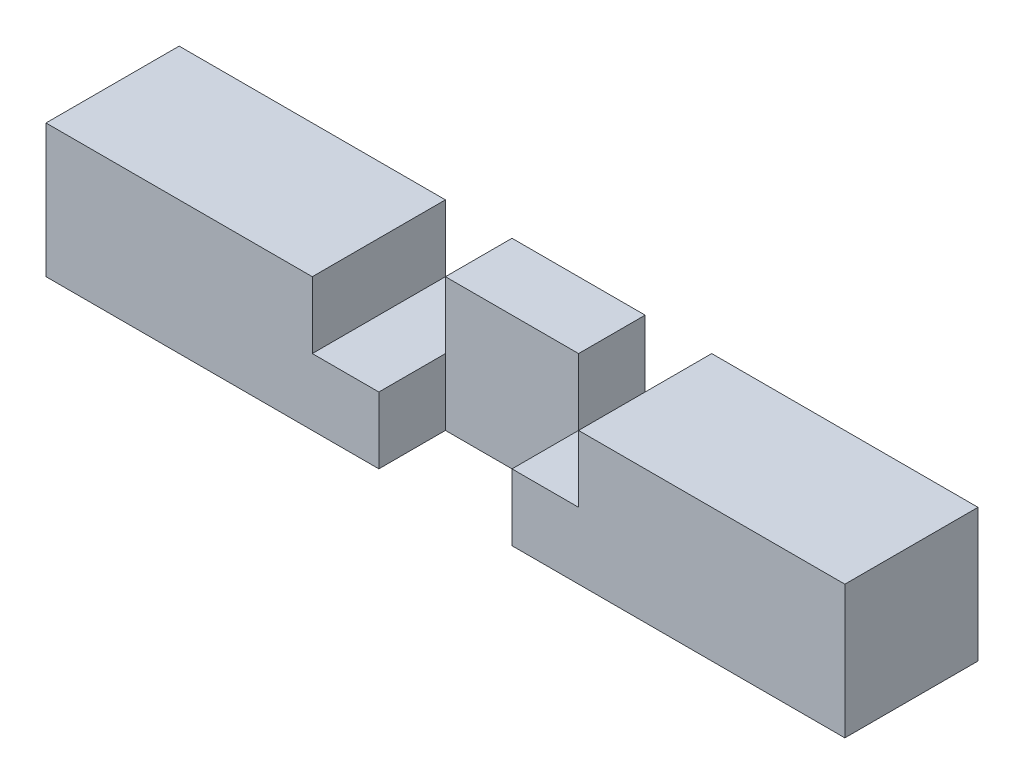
ISO-10303-21;
HEADER;
FILE_DESCRIPTION(('STEP AP214'),'2;1');
FILE_NAME('part.step','',(''),(''),'','','');
FILE_SCHEMA(('AUTOMOTIVE_DESIGN { 1 0 10303 214 1 1 1 1 }'));
ENDSEC;
DATA;
#1=APPLICATION_CONTEXT('core data for automotive mechanical design processes');
#2=APPLICATION_PROTOCOL_DEFINITION('international standard','automotive_design',2000,#1);
#3=PRODUCT_CONTEXT('',#1,'mechanical');
#4=PRODUCT('Part','Part','',(#3));
#5=PRODUCT_RELATED_PRODUCT_CATEGORY('part','',(#4));
#6=PRODUCT_DEFINITION_FORMATION('','',#4);
#7=PRODUCT_DEFINITION_CONTEXT('part definition',#1,'design');
#8=PRODUCT_DEFINITION('design','',#6,#7);
#9=PRODUCT_DEFINITION_SHAPE('','',#8);
#10=(LENGTH_UNIT() NAMED_UNIT(*) SI_UNIT(.MILLI.,.METRE.));
#11=(NAMED_UNIT(*) PLANE_ANGLE_UNIT() SI_UNIT($,.RADIAN.));
#12=(NAMED_UNIT(*) SI_UNIT($,.STERADIAN.) SOLID_ANGLE_UNIT());
#13=UNCERTAINTY_MEASURE_WITH_UNIT(LENGTH_MEASURE(1.E-05),#10,'distance_accuracy_value','');
#14=(GEOMETRIC_REPRESENTATION_CONTEXT(3) GLOBAL_UNCERTAINTY_ASSIGNED_CONTEXT((#13)) GLOBAL_UNIT_ASSIGNED_CONTEXT((#10,
#11,#12)) REPRESENTATION_CONTEXT('',''));
#15=CARTESIAN_POINT('',(0.,0.,0.));
#16=DIRECTION('',(0.,0.,1.));
#17=DIRECTION('',(1.,0.,0.));
#18=AXIS2_PLACEMENT_3D('',#15,#16,#17);
#19=CARTESIAN_POINT('',(0.,20.,0.));
#20=DIRECTION('',(0.,0.,-1.));
#21=DIRECTION('',(-1.,0.,0.));
#22=AXIS2_PLACEMENT_3D('',#19,#20,#21);
#23=PLANE('',#22);
#24=DIRECTION('',(1.,0.,0.));
#25=VECTOR('',#24,1.);
#26=CARTESIAN_POINT('',(0.,0.,0.));
#27=LINE('',#26,#25);
#28=CARTESIAN_POINT('',(0.,0.,0.));
#29=VERTEX_POINT('',#28);
#30=CARTESIAN_POINT('',(50.,0.,0.));
#31=VERTEX_POINT('',#30);
#32=EDGE_CURVE('E166',#29,#31,#27,.T.);
#33=ORIENTED_EDGE('',*,*,#32,.T.);
#34=DIRECTION('',(0.,1.,0.));
#35=VECTOR('',#34,1.);
#36=CARTESIAN_POINT('',(50.,0.,0.));
#37=LINE('',#36,#35);
#38=CARTESIAN_POINT('',(50.,10.,0.));
#39=VERTEX_POINT('',#38);
#40=EDGE_CURVE('E149',#31,#39,#37,.T.);
#41=ORIENTED_EDGE('',*,*,#40,.T.);
#42=DIRECTION('',(1.,0.,0.));
#43=VECTOR('',#42,1.);
#44=CARTESIAN_POINT('',(40.,10.,0.));
#45=LINE('',#44,#43);
#46=CARTESIAN_POINT('',(40.,10.,0.));
#47=VERTEX_POINT('',#46);
#48=EDGE_CURVE('E209',#47,#39,#45,.T.);
#49=ORIENTED_EDGE('',*,*,#48,.F.);
#50=DIRECTION('',(0.,-1.,0.));
#51=VECTOR('',#50,1.);
#52=CARTESIAN_POINT('',(40.,20.,0.));
#53=LINE('',#52,#51);
#54=CARTESIAN_POINT('',(40.,20.,0.));
#55=VERTEX_POINT('',#54);
#56=EDGE_CURVE('E248',#55,#47,#53,.T.);
#57=ORIENTED_EDGE('',*,*,#56,.F.);
#58=DIRECTION('',(1.,0.,0.));
#59=VECTOR('',#58,1.);
#60=CARTESIAN_POINT('',(0.,20.,0.));
#61=LINE('',#60,#59);
#62=CARTESIAN_POINT('',(0.,20.,0.));
#63=VERTEX_POINT('',#62);
#64=EDGE_CURVE('E84',#63,#55,#61,.T.);
#65=ORIENTED_EDGE('',*,*,#64,.F.);
#66=DIRECTION('',(0.,-1.,0.));
#67=VECTOR('',#66,1.);
#68=CARTESIAN_POINT('',(0.,20.,0.));
#69=LINE('',#68,#67);
#70=EDGE_CURVE('E11',#63,#29,#69,.T.);
#71=ORIENTED_EDGE('',*,*,#70,.T.);
#72=EDGE_LOOP('',(#33,#41,#49,#57,#65,#71));
#73=FACE_BOUND('',#72,.T.);
#74=ADVANCED_FACE('F31',(#73),#23,.F.);
#75=CARTESIAN_POINT('',(0.,20.,-20.));
#76=DIRECTION('',(0.,-1.,0.));
#77=DIRECTION('',(0.,0.,-1.));
#78=AXIS2_PLACEMENT_3D('',#75,#76,#77);
#79=PLANE('',#78);
#80=DIRECTION('',(0.,0.,1.));
#81=VECTOR('',#80,1.);
#82=CARTESIAN_POINT('',(50.,20.,-20.));
#83=LINE('',#82,#81);
#84=CARTESIAN_POINT('',(50.,20.,-20.));
#85=VERTEX_POINT('',#84);
#86=CARTESIAN_POINT('',(50.,20.,-10.));
#87=VERTEX_POINT('',#86);
#88=EDGE_CURVE('E201',#85,#87,#83,.T.);
#89=ORIENTED_EDGE('',*,*,#88,.T.);
#90=DIRECTION('',(-1.,0.,0.));
#91=VECTOR('',#90,1.);
#92=CARTESIAN_POINT('',(50.,20.,-10.));
#93=LINE('',#92,#91);
#94=CARTESIAN_POINT('',(70.,20.,-10.));
#95=VERTEX_POINT('',#94);
#96=EDGE_CURVE('E170',#95,#87,#93,.T.);
#97=ORIENTED_EDGE('',*,*,#96,.F.);
#98=DIRECTION('',(0.,0.,1.));
#99=VECTOR('',#98,1.);
#100=CARTESIAN_POINT('',(70.,20.,-20.));
#101=LINE('',#100,#99);
#102=CARTESIAN_POINT('',(70.,20.,-20.));
#103=VERTEX_POINT('',#102);
#104=EDGE_CURVE('E231',#103,#95,#101,.T.);
#105=ORIENTED_EDGE('',*,*,#104,.F.);
#106=DIRECTION('',(-1.,0.,0.));
#107=VECTOR('',#106,1.);
#108=CARTESIAN_POINT('',(0.,20.,-20.));
#109=LINE('',#108,#107);
#110=EDGE_CURVE('E221',#103,#85,#109,.T.);
#111=ORIENTED_EDGE('',*,*,#110,.T.);
#112=EDGE_LOOP('',(#89,#97,#105,#111));
#113=FACE_BOUND('',#112,.T.);
#114=ADVANCED_FACE('F228',(#113),#79,.F.);
#115=ORIENTED_EDGE('',*,*,#64,.T.);
#116=DIRECTION('',(0.,0.,1.));
#117=VECTOR('',#116,1.);
#118=CARTESIAN_POINT('',(40.,20.,-20.));
#119=LINE('',#118,#117);
#120=CARTESIAN_POINT('',(40.,20.,-20.));
#121=VERTEX_POINT('',#120);
#122=EDGE_CURVE('E200',#121,#55,#119,.T.);
#123=ORIENTED_EDGE('',*,*,#122,.F.);
#124=CARTESIAN_POINT('',(0.,20.,-20.));
#125=VERTEX_POINT('',#124);
#126=EDGE_CURVE('E55',#121,#125,#109,.T.);
#127=ORIENTED_EDGE('',*,*,#126,.T.);
#128=DIRECTION('',(0.,0.,1.));
#129=VECTOR('',#128,1.);
#130=CARTESIAN_POINT('',(0.,20.,0.));
#131=LINE('',#130,#129);
#132=EDGE_CURVE('E183',#125,#63,#131,.T.);
#133=ORIENTED_EDGE('',*,*,#132,.T.);
#134=EDGE_LOOP('',(#115,#123,#127,#133));
#135=FACE_BOUND('',#134,.T.);
#136=ADVANCED_FACE('F263',(#135),#79,.F.);
#137=CARTESIAN_POINT('',(0.,20.,0.));
#138=DIRECTION('',(1.,0.,0.));
#139=DIRECTION('',(0.,0.,-1.));
#140=AXIS2_PLACEMENT_3D('',#137,#138,#139);
#141=PLANE('',#140);
#142=DIRECTION('',(0.,0.,1.));
#143=VECTOR('',#142,1.);
#144=CARTESIAN_POINT('',(0.,0.,0.));
#145=LINE('',#144,#143);
#146=CARTESIAN_POINT('',(0.,0.,-20.));
#147=VERTEX_POINT('',#146);
#148=EDGE_CURVE('E178',#147,#29,#145,.T.);
#149=ORIENTED_EDGE('',*,*,#148,.T.);
#150=ORIENTED_EDGE('',*,*,#70,.F.);
#151=ORIENTED_EDGE('',*,*,#132,.F.);
#152=DIRECTION('',(0.,-1.,0.));
#153=VECTOR('',#152,1.);
#154=CARTESIAN_POINT('',(0.,20.,-20.));
#155=LINE('',#154,#153);
#156=EDGE_CURVE('E184',#125,#147,#155,.T.);
#157=ORIENTED_EDGE('',*,*,#156,.T.);
#158=EDGE_LOOP('',(#149,#150,#151,#157));
#159=FACE_BOUND('',#158,.T.);
#160=ADVANCED_FACE('F33',(#159),#141,.F.);
#161=DIRECTION('',(1.,0.,0.));
#162=VECTOR('',#161,1.);
#163=CARTESIAN_POINT('',(70.,10.,0.));
#164=LINE('',#163,#162);
#165=CARTESIAN_POINT('',(70.,10.,0.));
#166=VERTEX_POINT('',#165);
#167=CARTESIAN_POINT('',(80.,10.,0.));
#168=VERTEX_POINT('',#167);
#169=EDGE_CURVE('E322',#166,#168,#164,.T.);
#170=ORIENTED_EDGE('',*,*,#169,.F.);
#171=DIRECTION('',(0.,1.,0.));
#172=VECTOR('',#171,1.);
#173=CARTESIAN_POINT('',(70.,0.,0.));
#174=LINE('',#173,#172);
#175=CARTESIAN_POINT('',(70.,0.,0.));
#176=VERTEX_POINT('',#175);
#177=EDGE_CURVE('E160',#176,#166,#174,.T.);
#178=ORIENTED_EDGE('',*,*,#177,.F.);
#179=CARTESIAN_POINT('',(120.,0.,0.));
#180=VERTEX_POINT('',#179);
#181=EDGE_CURVE('E175',#176,#180,#27,.T.);
#182=ORIENTED_EDGE('',*,*,#181,.T.);
#183=DIRECTION('',(0.,-1.,0.));
#184=VECTOR('',#183,1.);
#185=CARTESIAN_POINT('',(120.,20.,0.));
#186=LINE('',#185,#184);
#187=CARTESIAN_POINT('',(120.,20.,0.));
#188=VERTEX_POINT('',#187);
#189=EDGE_CURVE('E39',#188,#180,#186,.T.);
#190=ORIENTED_EDGE('',*,*,#189,.F.);
#191=CARTESIAN_POINT('',(80.,20.,0.));
#192=VERTEX_POINT('',#191);
#193=EDGE_CURVE('E218',#192,#188,#61,.T.);
#194=ORIENTED_EDGE('',*,*,#193,.F.);
#195=DIRECTION('',(0.,1.,0.));
#196=VECTOR('',#195,1.);
#197=CARTESIAN_POINT('',(80.,20.,0.));
#198=LINE('',#197,#196);
#199=EDGE_CURVE('E46',#168,#192,#198,.T.);
#200=ORIENTED_EDGE('',*,*,#199,.F.);
#201=EDGE_LOOP('',(#170,#178,#182,#190,#194,#200));
#202=FACE_BOUND('',#201,.T.);
#203=ADVANCED_FACE('F266',(#202),#23,.F.);
#204=CARTESIAN_POINT('',(120.,20.,0.));
#205=DIRECTION('',(-1.,0.,0.));
#206=DIRECTION('',(0.,0.,1.));
#207=AXIS2_PLACEMENT_3D('',#204,#205,#206);
#208=PLANE('',#207);
#209=DIRECTION('',(0.,0.,-1.));
#210=VECTOR('',#209,1.);
#211=CARTESIAN_POINT('',(120.,0.,0.));
#212=LINE('',#211,#210);
#213=CARTESIAN_POINT('',(120.,0.,-20.));
#214=VERTEX_POINT('',#213);
#215=EDGE_CURVE('E174',#180,#214,#212,.T.);
#216=ORIENTED_EDGE('',*,*,#215,.T.);
#217=DIRECTION('',(0.,-1.,0.));
#218=VECTOR('',#217,1.);
#219=CARTESIAN_POINT('',(120.,20.,-20.));
#220=LINE('',#219,#218);
#221=CARTESIAN_POINT('',(120.,20.,-20.));
#222=VERTEX_POINT('',#221);
#223=EDGE_CURVE('E186',#222,#214,#220,.T.);
#224=ORIENTED_EDGE('',*,*,#223,.F.);
#225=DIRECTION('',(0.,0.,-1.));
#226=VECTOR('',#225,1.);
#227=CARTESIAN_POINT('',(120.,20.,0.));
#228=LINE('',#227,#226);
#229=EDGE_CURVE('E195',#188,#222,#228,.T.);
#230=ORIENTED_EDGE('',*,*,#229,.F.);
#231=ORIENTED_EDGE('',*,*,#189,.T.);
#232=EDGE_LOOP('',(#216,#224,#230,#231));
#233=FACE_BOUND('',#232,.T.);
#234=ADVANCED_FACE('F193',(#233),#208,.F.);
#235=CARTESIAN_POINT('',(0.,20.,-20.));
#236=DIRECTION('',(0.,0.,1.));
#237=DIRECTION('',(1.,0.,0.));
#238=AXIS2_PLACEMENT_3D('',#235,#236,#237);
#239=PLANE('',#238);
#240=ORIENTED_EDGE('',*,*,#110,.F.);
#241=DIRECTION('',(0.,-1.,0.));
#242=VECTOR('',#241,1.);
#243=CARTESIAN_POINT('',(70.,20.,-20.));
#244=LINE('',#243,#242);
#245=CARTESIAN_POINT('',(70.,10.,-20.));
#246=VERTEX_POINT('',#245);
#247=EDGE_CURVE('E326',#103,#246,#244,.T.);
#248=ORIENTED_EDGE('',*,*,#247,.T.);
#249=DIRECTION('',(1.,0.,0.));
#250=VECTOR('',#249,1.);
#251=CARTESIAN_POINT('',(70.,10.,-20.));
#252=LINE('',#251,#250);
#253=CARTESIAN_POINT('',(80.,10.,-20.));
#254=VERTEX_POINT('',#253);
#255=EDGE_CURVE('E328',#246,#254,#252,.T.);
#256=ORIENTED_EDGE('',*,*,#255,.T.);
#257=DIRECTION('',(0.,1.,0.));
#258=VECTOR('',#257,1.);
#259=CARTESIAN_POINT('',(80.,20.,-20.));
#260=LINE('',#259,#258);
#261=CARTESIAN_POINT('',(80.,20.,-20.));
#262=VERTEX_POINT('',#261);
#263=EDGE_CURVE('E331',#254,#262,#260,.T.);
#264=ORIENTED_EDGE('',*,*,#263,.T.);
#265=EDGE_CURVE('E187',#222,#262,#109,.T.);
#266=ORIENTED_EDGE('',*,*,#265,.F.);
#267=ORIENTED_EDGE('',*,*,#223,.T.);
#268=DIRECTION('',(-1.,0.,0.));
#269=VECTOR('',#268,1.);
#270=CARTESIAN_POINT('',(0.,0.,-20.));
#271=LINE('',#270,#269);
#272=EDGE_CURVE('E77',#214,#147,#271,.T.);
#273=ORIENTED_EDGE('',*,*,#272,.T.);
#274=ORIENTED_EDGE('',*,*,#156,.F.);
#275=ORIENTED_EDGE('',*,*,#126,.F.);
#276=DIRECTION('',(0.,-1.,0.));
#277=VECTOR('',#276,1.);
#278=CARTESIAN_POINT('',(40.,20.,-20.));
#279=LINE('',#278,#277);
#280=CARTESIAN_POINT('',(40.,10.,-20.));
#281=VERTEX_POINT('',#280);
#282=EDGE_CURVE('E245',#121,#281,#279,.T.);
#283=ORIENTED_EDGE('',*,*,#282,.T.);
#284=DIRECTION('',(1.,0.,0.));
#285=VECTOR('',#284,1.);
#286=CARTESIAN_POINT('',(40.,10.,-20.));
#287=LINE('',#286,#285);
#288=CARTESIAN_POINT('',(50.,10.,-20.));
#289=VERTEX_POINT('',#288);
#290=EDGE_CURVE('E243',#281,#289,#287,.T.);
#291=ORIENTED_EDGE('',*,*,#290,.T.);
#292=DIRECTION('',(0.,1.,0.));
#293=VECTOR('',#292,1.);
#294=CARTESIAN_POINT('',(50.,20.,-20.));
#295=LINE('',#294,#293);
#296=EDGE_CURVE('E216',#289,#85,#295,.T.);
#297=ORIENTED_EDGE('',*,*,#296,.T.);
#298=EDGE_LOOP('',(#240,#248,#256,#264,#266,#267,#273,#274,#275,#283,#291,#297));
#299=FACE_BOUND('',#298,.T.);
#300=ADVANCED_FACE('F240',(#299),#239,.F.);
#301=ORIENTED_EDGE('',*,*,#265,.T.);
#302=DIRECTION('',(0.,0.,1.));
#303=VECTOR('',#302,1.);
#304=CARTESIAN_POINT('',(80.,20.,-20.));
#305=LINE('',#304,#303);
#306=EDGE_CURVE('E249',#262,#192,#305,.T.);
#307=ORIENTED_EDGE('',*,*,#306,.T.);
#308=ORIENTED_EDGE('',*,*,#193,.T.);
#309=ORIENTED_EDGE('',*,*,#229,.T.);
#310=EDGE_LOOP('',(#301,#307,#308,#309));
#311=FACE_BOUND('',#310,.T.);
#312=ADVANCED_FACE('F272',(#311),#79,.F.);
#313=CARTESIAN_POINT('',(0.,0.,-20.));
#314=DIRECTION('',(0.,-1.,0.));
#315=DIRECTION('',(0.,0.,-1.));
#316=AXIS2_PLACEMENT_3D('',#313,#314,#315);
#317=PLANE('',#316);
#318=DIRECTION('',(0.,0.,1.));
#319=VECTOR('',#318,1.);
#320=CARTESIAN_POINT('',(50.,0.,0.));
#321=LINE('',#320,#319);
#322=CARTESIAN_POINT('',(50.,0.,-10.));
#323=VERTEX_POINT('',#322);
#324=EDGE_CURVE('E153',#323,#31,#321,.T.);
#325=ORIENTED_EDGE('',*,*,#324,.T.);
#326=ORIENTED_EDGE('',*,*,#32,.F.);
#327=ORIENTED_EDGE('',*,*,#148,.F.);
#328=ORIENTED_EDGE('',*,*,#272,.F.);
#329=ORIENTED_EDGE('',*,*,#215,.F.);
#330=ORIENTED_EDGE('',*,*,#181,.F.);
#331=DIRECTION('',(0.,0.,-1.));
#332=VECTOR('',#331,1.);
#333=CARTESIAN_POINT('',(70.,0.,0.));
#334=LINE('',#333,#332);
#335=CARTESIAN_POINT('',(70.,0.,-10.));
#336=VERTEX_POINT('',#335);
#337=EDGE_CURVE('E169',#176,#336,#334,.T.);
#338=ORIENTED_EDGE('',*,*,#337,.T.);
#339=DIRECTION('',(-1.,0.,0.));
#340=VECTOR('',#339,1.);
#341=CARTESIAN_POINT('',(50.,0.,-10.));
#342=LINE('',#341,#340);
#343=EDGE_CURVE('E161',#336,#323,#342,.T.);
#344=ORIENTED_EDGE('',*,*,#343,.T.);
#345=EDGE_LOOP('',(#325,#326,#327,#328,#329,#330,#338,#344));
#346=FACE_BOUND('',#345,.T.);
#347=ADVANCED_FACE('F164',(#346),#317,.T.);
#348=CARTESIAN_POINT('',(40.,20.,-20.));
#349=DIRECTION('',(-1.,0.,0.));
#350=DIRECTION('',(0.,0.,1.));
#351=AXIS2_PLACEMENT_3D('',#348,#349,#350);
#352=PLANE('',#351);
#353=ORIENTED_EDGE('',*,*,#56,.T.);
#354=DIRECTION('',(0.,0.,1.));
#355=VECTOR('',#354,1.);
#356=CARTESIAN_POINT('',(40.,10.,-20.));
#357=LINE('',#356,#355);
#358=EDGE_CURVE('E214',#281,#47,#357,.T.);
#359=ORIENTED_EDGE('',*,*,#358,.F.);
#360=ORIENTED_EDGE('',*,*,#282,.F.);
#361=ORIENTED_EDGE('',*,*,#122,.T.);
#362=EDGE_LOOP('',(#353,#359,#360,#361));
#363=FACE_BOUND('',#362,.T.);
#364=ADVANCED_FACE('F262',(#363),#352,.F.);
#365=CARTESIAN_POINT('',(50.,20.,-20.));
#366=DIRECTION('',(1.,0.,0.));
#367=DIRECTION('',(0.,0.,-1.));
#368=AXIS2_PLACEMENT_3D('',#365,#366,#367);
#369=PLANE('',#368);
#370=DIRECTION('',(0.,0.,1.));
#371=VECTOR('',#370,1.);
#372=CARTESIAN_POINT('',(50.,10.,-20.));
#373=LINE('',#372,#371);
#374=CARTESIAN_POINT('',(50.,10.,-10.));
#375=VERTEX_POINT('',#374);
#376=EDGE_CURVE('E206',#289,#375,#373,.T.);
#377=ORIENTED_EDGE('',*,*,#376,.T.);
#378=DIRECTION('',(0.,1.,0.));
#379=VECTOR('',#378,1.);
#380=CARTESIAN_POINT('',(50.,0.,-10.));
#381=LINE('',#380,#379);
#382=EDGE_CURVE('E239',#375,#87,#381,.T.);
#383=ORIENTED_EDGE('',*,*,#382,.T.);
#384=ORIENTED_EDGE('',*,*,#88,.F.);
#385=ORIENTED_EDGE('',*,*,#296,.F.);
#386=EDGE_LOOP('',(#377,#383,#384,#385));
#387=FACE_BOUND('',#386,.T.);
#388=ADVANCED_FACE('F237',(#387),#369,.F.);
#389=CARTESIAN_POINT('',(40.,10.,-20.));
#390=DIRECTION('',(0.,-1.,0.));
#391=DIRECTION('',(0.,0.,-1.));
#392=AXIS2_PLACEMENT_3D('',#389,#390,#391);
#393=PLANE('',#392);
#394=ORIENTED_EDGE('',*,*,#48,.T.);
#395=EDGE_CURVE('E156',#375,#39,#373,.T.);
#396=ORIENTED_EDGE('',*,*,#395,.F.);
#397=ORIENTED_EDGE('',*,*,#376,.F.);
#398=ORIENTED_EDGE('',*,*,#290,.F.);
#399=ORIENTED_EDGE('',*,*,#358,.T.);
#400=EDGE_LOOP('',(#394,#396,#397,#398,#399));
#401=FACE_BOUND('',#400,.T.);
#402=ADVANCED_FACE('F287',(#401),#393,.F.);
#403=CARTESIAN_POINT('',(70.,20.,-20.));
#404=DIRECTION('',(-1.,0.,0.));
#405=DIRECTION('',(0.,0.,1.));
#406=AXIS2_PLACEMENT_3D('',#403,#404,#405);
#407=PLANE('',#406);
#408=ORIENTED_EDGE('',*,*,#104,.T.);
#409=DIRECTION('',(0.,1.,0.));
#410=VECTOR('',#409,1.);
#411=CARTESIAN_POINT('',(70.,0.,-10.));
#412=LINE('',#411,#410);
#413=CARTESIAN_POINT('',(70.,10.,-10.));
#414=VERTEX_POINT('',#413);
#415=EDGE_CURVE('E315',#414,#95,#412,.T.);
#416=ORIENTED_EDGE('',*,*,#415,.F.);
#417=DIRECTION('',(0.,0.,1.));
#418=VECTOR('',#417,1.);
#419=CARTESIAN_POINT('',(70.,10.,-20.));
#420=LINE('',#419,#418);
#421=EDGE_CURVE('E259',#246,#414,#420,.T.);
#422=ORIENTED_EDGE('',*,*,#421,.F.);
#423=ORIENTED_EDGE('',*,*,#247,.F.);
#424=EDGE_LOOP('',(#408,#416,#422,#423));
#425=FACE_BOUND('',#424,.T.);
#426=ADVANCED_FACE('F290',(#425),#407,.F.);
#427=CARTESIAN_POINT('',(80.,20.,-20.));
#428=DIRECTION('',(1.,0.,0.));
#429=DIRECTION('',(0.,0.,-1.));
#430=AXIS2_PLACEMENT_3D('',#427,#428,#429);
#431=PLANE('',#430);
#432=ORIENTED_EDGE('',*,*,#199,.T.);
#433=ORIENTED_EDGE('',*,*,#306,.F.);
#434=ORIENTED_EDGE('',*,*,#263,.F.);
#435=DIRECTION('',(0.,0.,1.));
#436=VECTOR('',#435,1.);
#437=CARTESIAN_POINT('',(80.,10.,-20.));
#438=LINE('',#437,#436);
#439=EDGE_CURVE('E253',#254,#168,#438,.T.);
#440=ORIENTED_EDGE('',*,*,#439,.T.);
#441=EDGE_LOOP('',(#432,#433,#434,#440));
#442=FACE_BOUND('',#441,.T.);
#443=ADVANCED_FACE('F296',(#442),#431,.F.);
#444=CARTESIAN_POINT('',(70.,10.,-20.));
#445=DIRECTION('',(0.,-1.,0.));
#446=DIRECTION('',(0.,0.,-1.));
#447=AXIS2_PLACEMENT_3D('',#444,#445,#446);
#448=PLANE('',#447);
#449=ORIENTED_EDGE('',*,*,#169,.T.);
#450=ORIENTED_EDGE('',*,*,#439,.F.);
#451=ORIENTED_EDGE('',*,*,#255,.F.);
#452=ORIENTED_EDGE('',*,*,#421,.T.);
#453=EDGE_CURVE('E261',#414,#166,#420,.T.);
#454=ORIENTED_EDGE('',*,*,#453,.T.);
#455=EDGE_LOOP('',(#449,#450,#451,#452,#454));
#456=FACE_BOUND('',#455,.T.);
#457=ADVANCED_FACE('F297',(#456),#448,.F.);
#458=CARTESIAN_POINT('',(50.,0.,0.));
#459=DIRECTION('',(-1.,0.,0.));
#460=DIRECTION('',(0.,0.,1.));
#461=AXIS2_PLACEMENT_3D('',#458,#459,#460);
#462=PLANE('',#461);
#463=ORIENTED_EDGE('',*,*,#40,.F.);
#464=ORIENTED_EDGE('',*,*,#324,.F.);
#465=EDGE_CURVE('E320',#323,#375,#381,.T.);
#466=ORIENTED_EDGE('',*,*,#465,.T.);
#467=ORIENTED_EDGE('',*,*,#395,.T.);
#468=EDGE_LOOP('',(#463,#464,#466,#467));
#469=FACE_BOUND('',#468,.T.);
#470=ADVANCED_FACE('F151',(#469),#462,.F.);
#471=CARTESIAN_POINT('',(70.,0.,0.));
#472=DIRECTION('',(1.,0.,0.));
#473=DIRECTION('',(0.,0.,-1.));
#474=AXIS2_PLACEMENT_3D('',#471,#472,#473);
#475=PLANE('',#474);
#476=EDGE_CURVE('E323',#336,#414,#412,.T.);
#477=ORIENTED_EDGE('',*,*,#476,.F.);
#478=ORIENTED_EDGE('',*,*,#337,.F.);
#479=ORIENTED_EDGE('',*,*,#177,.T.);
#480=ORIENTED_EDGE('',*,*,#453,.F.);
#481=EDGE_LOOP('',(#477,#478,#479,#480));
#482=FACE_BOUND('',#481,.T.);
#483=ADVANCED_FACE('F305',(#482),#475,.F.);
#484=CARTESIAN_POINT('',(50.,0.,-10.));
#485=DIRECTION('',(0.,0.,-1.));
#486=DIRECTION('',(-1.,0.,0.));
#487=AXIS2_PLACEMENT_3D('',#484,#485,#486);
#488=PLANE('',#487);
#489=ORIENTED_EDGE('',*,*,#96,.T.);
#490=ORIENTED_EDGE('',*,*,#382,.F.);
#491=ORIENTED_EDGE('',*,*,#465,.F.);
#492=ORIENTED_EDGE('',*,*,#343,.F.);
#493=ORIENTED_EDGE('',*,*,#476,.T.);
#494=ORIENTED_EDGE('',*,*,#415,.T.);
#495=EDGE_LOOP('',(#489,#490,#491,#492,#493,#494));
#496=FACE_BOUND('',#495,.T.);
#497=ADVANCED_FACE('F308',(#496),#488,.F.);
#498=CLOSED_SHELL('',(#74,#114,#136,#160,#203,#234,#300,#312,#347,#364,#388,#402,#426,#443,#457,
#470,#483,#497));
#499=MANIFOLD_SOLID_BREP('B2',#498);
#500=ADVANCED_BREP_SHAPE_REPRESENTATION('',(#18,#499),#14);
#501=SHAPE_DEFINITION_REPRESENTATION(#9,#500);
ENDSEC;
END-ISO-10303-21;
